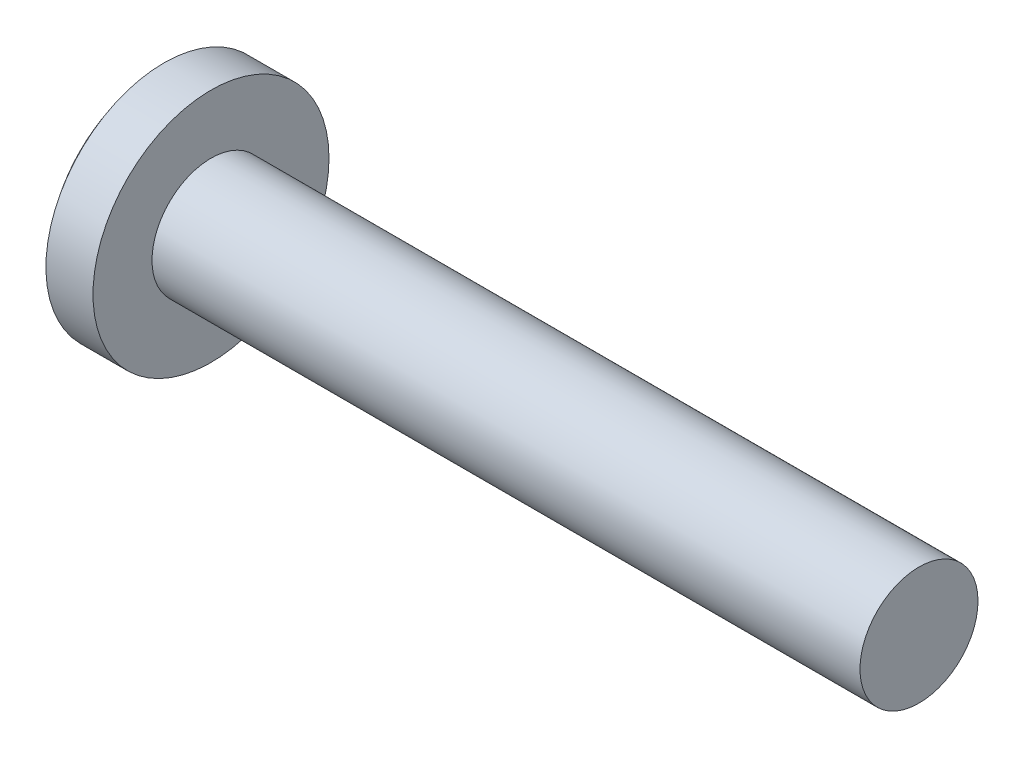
from build123d import *

# Parameters (mm, degrees)
CUT_EXTRUDE2_DEPTH = 1.3
FILLET5_R          = 0.3
DRAFT2_ANGLE       = -30


with BuildPart() as part:
    # Sketch1 → Base (revolve)
    with BuildSketch(Plane.XY, mode=Mode.PRIVATE) as base_sk:
        with BuildLine():
            Line((67.5, 5), (10.5, 5))
            Line((10.5, 5), (7.5, 5))
            Line((7.5, 5), (7.5, 5.6))
            Line((7.5, 5.6), (7.5, 10))
            Line((7.5, 10), (3.510004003, 10))
            ThreePointArc((3.510004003, 10), (0.902981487, 5.299059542), (0, 0))
            Line((0, 0), (67.5, 0))
            Line((67.5, 0), (67.5, 5))
        make_face()
    revolve(base_sk.sketch.rotate(Axis((4.515812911, 0, 0), (-1, 0, 0)), 90), axis=Axis((4.515812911, 0, 0), (-1, 0, 0)))

    # Sketch6 → Cut-Extrude2 (cut)
    with BuildSketch(Plane(origin=(0, 0, 0), x_dir=(0, 0, -1), z_dir=(1, 0, 0))):
        Polygon((1.01, 1.01), (1.01, 5.05), (-1.01, 5.05), (-1.01, 1.01), (-5.05, 1.01), (-5.05, -1.01), (-1.01, -1.01), (-1.01, -5.05), (1.01, -5.05), (1.01, -1.01), (5.05, -1.01), (5.05, 1.01), align=None)
    extrude(amount=CUT_EXTRUDE2_DEPTH, mode=Mode.SUBTRACT)

    # Fillet5
    fillet5_edges = [part.edges().sort_by_distance(p)[0] for p in [
        (0.681941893, 1.01, 1.01),
        (0.681941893, -1.01, 1.01),
        (0.681941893, -1.01, -1.01),
        (0.681941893, 1.01, -1.01),
    ]]
    fillet(fillet5_edges, radius=FILLET5_R)

    # Draft2
    draft2_faces = [part.faces().sort_by_distance(p)[0] for p in [
        (1.064424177, 0, 5.05),
        (1.064424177, 5.05, 0),
        (1.064424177, -5.05, 0),
        (1.064424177, 0, -5.05),
    ]]
    draft(draft2_faces, Plane(origin=(0, 0, 0), x_dir=(0, 0, 1), z_dir=(1, 0, 0)), DRAFT2_ANGLE)


solid = part.part
